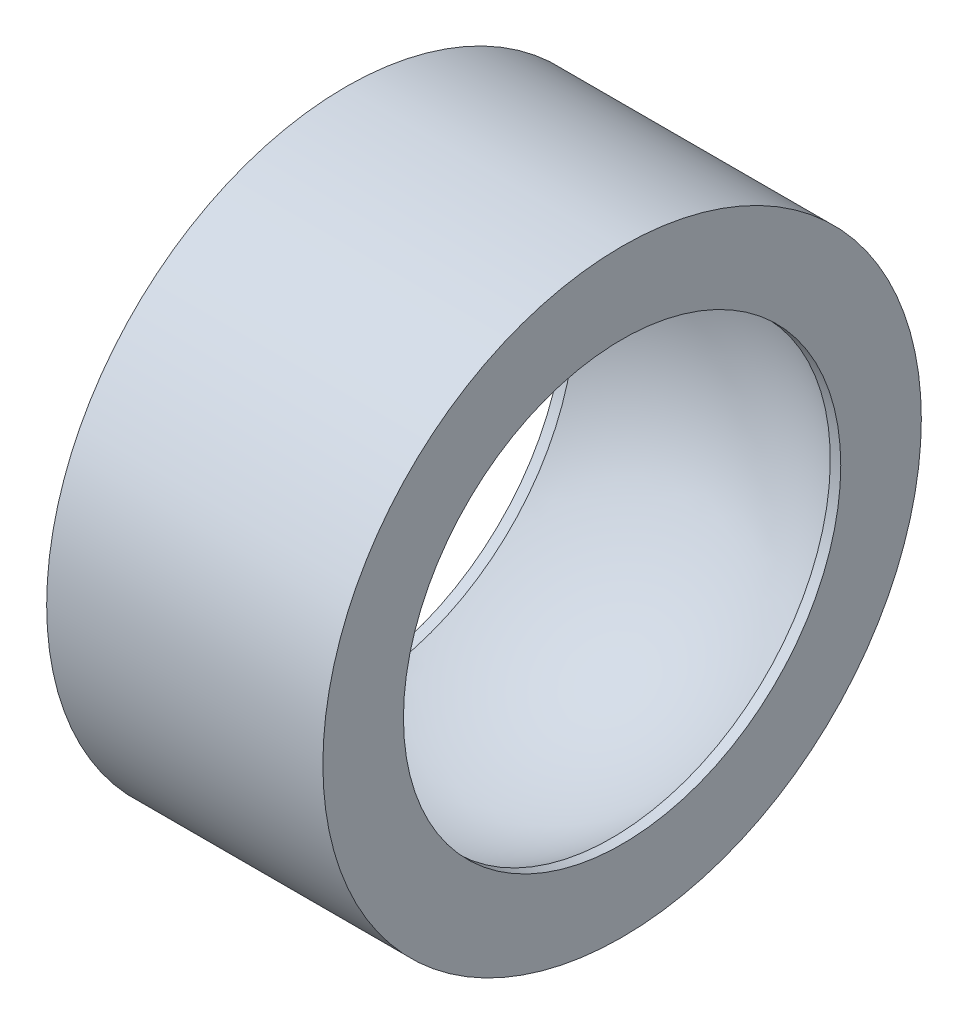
ISO-10303-21;
HEADER;
FILE_DESCRIPTION(('STEP AP214'),'2;1');
FILE_NAME('part.step','',(''),(''),'','','');
FILE_SCHEMA(('AUTOMOTIVE_DESIGN { 1 0 10303 214 1 1 1 1 }'));
ENDSEC;
DATA;
#1=APPLICATION_CONTEXT('core data for automotive mechanical design processes');
#2=APPLICATION_PROTOCOL_DEFINITION('international standard','automotive_design',2000,#1);
#3=PRODUCT_CONTEXT('',#1,'mechanical');
#4=PRODUCT('Part','Part','',(#3));
#5=PRODUCT_RELATED_PRODUCT_CATEGORY('part','',(#4));
#6=PRODUCT_DEFINITION_FORMATION('','',#4);
#7=PRODUCT_DEFINITION_CONTEXT('part definition',#1,'design');
#8=PRODUCT_DEFINITION('design','',#6,#7);
#9=PRODUCT_DEFINITION_SHAPE('','',#8);
#10=(LENGTH_UNIT() NAMED_UNIT(*) SI_UNIT(.MILLI.,.METRE.));
#11=(NAMED_UNIT(*) PLANE_ANGLE_UNIT() SI_UNIT($,.RADIAN.));
#12=(NAMED_UNIT(*) SI_UNIT($,.STERADIAN.) SOLID_ANGLE_UNIT());
#13=UNCERTAINTY_MEASURE_WITH_UNIT(LENGTH_MEASURE(1.E-05),#10,'distance_accuracy_value','');
#14=(GEOMETRIC_REPRESENTATION_CONTEXT(3) GLOBAL_UNCERTAINTY_ASSIGNED_CONTEXT((#13)) GLOBAL_UNIT_ASSIGNED_CONTEXT((#10,
#11,#12)) REPRESENTATION_CONTEXT('',''));
#15=CARTESIAN_POINT('',(0.,0.,0.));
#16=DIRECTION('',(0.,0.,1.));
#17=DIRECTION('',(1.,0.,0.));
#18=AXIS2_PLACEMENT_3D('',#15,#16,#17);
#19=CARTESIAN_POINT('',(0.,13.,0.));
#20=DIRECTION('',(1.,0.,0.));
#21=DIRECTION('',(0.,0.,-1.));
#22=AXIS2_PLACEMENT_3D('',#19,#20,#21);
#23=PLANE('',#22);
#24=CARTESIAN_POINT('',(0.,0.,0.));
#25=DIRECTION('',(-1.,0.,0.));
#26=DIRECTION('',(0.,0.,1.));
#27=AXIS2_PLACEMENT_3D('',#24,#25,#26);
#28=CIRCLE('',#27,9.5);
#29=CARTESIAN_POINT('',(0.,0.,9.5));
#30=VERTEX_POINT('',#29);
#31=EDGE_CURVE('E10',#30,#30,#28,.T.);
#32=ORIENTED_EDGE('',*,*,#31,.F.);
#33=EDGE_LOOP('',(#32));
#34=FACE_BOUND('',#33,.T.);
#35=CARTESIAN_POINT('',(0.,0.,0.));
#36=DIRECTION('',(-1.,0.,0.));
#37=DIRECTION('',(0.,0.,1.));
#38=AXIS2_PLACEMENT_3D('',#35,#36,#37);
#39=CIRCLE('',#38,13.);
#40=CARTESIAN_POINT('',(0.,0.,13.));
#41=VERTEX_POINT('',#40);
#42=EDGE_CURVE('E48',#41,#41,#39,.T.);
#43=ORIENTED_EDGE('',*,*,#42,.T.);
#44=EDGE_LOOP('',(#43));
#45=FACE_BOUND('',#44,.T.);
#46=ADVANCED_FACE('F26',(#34,#45),#23,.F.);
#47=CARTESIAN_POINT('',(0.,0.,0.));
#48=DIRECTION('',(-1.,0.,0.));
#49=DIRECTION('',(0.,0.,1.));
#50=AXIS2_PLACEMENT_3D('',#47,#48,#49);
#51=CYLINDRICAL_SURFACE('',#50,9.5);
#52=CARTESIAN_POINT('',(0.454731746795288,0.,0.));
#53=DIRECTION('',(-1.,0.,0.));
#54=DIRECTION('',(0.,0.,1.));
#55=AXIS2_PLACEMENT_3D('',#52,#53,#54);
#56=CIRCLE('',#55,9.5);
#57=CARTESIAN_POINT('',(0.454731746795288,9.5,0.));
#58=VERTEX_POINT('',#57);
#59=EDGE_CURVE('E32',#58,#58,#56,.T.);
#60=ORIENTED_EDGE('',*,*,#59,.F.);
#61=EDGE_LOOP('',(#60));
#62=FACE_BOUND('',#61,.T.);
#63=ORIENTED_EDGE('',*,*,#31,.T.);
#64=EDGE_LOOP('',(#63));
#65=FACE_BOUND('',#64,.T.);
#66=ADVANCED_FACE('F73',(#62,#65),#51,.F.);
#67=CARTESIAN_POINT('',(6.,0.,0.));
#68=DIRECTION('',(-1.,0.,0.));
#69=DIRECTION('',(0.,1.,0.));
#70=AXIS2_PLACEMENT_3D('',#67,#68,#69);
#71=SPHERICAL_SURFACE('',#70,11.);
#72=CARTESIAN_POINT('',(11.5452682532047,0.,0.));
#73=DIRECTION('',(-1.,0.,0.));
#74=DIRECTION('',(0.,0.,1.));
#75=AXIS2_PLACEMENT_3D('',#72,#73,#74);
#76=CIRCLE('',#75,9.5);
#77=CARTESIAN_POINT('',(11.5452682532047,9.5,0.));
#78=VERTEX_POINT('',#77);
#79=EDGE_CURVE('E36',#78,#78,#76,.T.);
#80=CARTESIAN_POINT('',(11.5452682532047,9.5,0.));
#81=CARTESIAN_POINT('',(11.4406979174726,9.56103991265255,0.));
#82=CARTESIAN_POINT('',(11.3351190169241,9.6203518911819,0.));
#83=CARTESIAN_POINT('',(11.1220608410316,9.73545833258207,0.));
#84=CARTESIAN_POINT('',(11.0145815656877,9.79125279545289,0.));
#85=CARTESIAN_POINT('',(10.7978393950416,9.89926255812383,0.));
#86=CARTESIAN_POINT('',(10.6885764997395,9.95147785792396,0.));
#87=CARTESIAN_POINT('',(10.4683863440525,10.0522725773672,0.));
#88=CARTESIAN_POINT('',(10.3574590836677,10.1008519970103,0.));
#89=CARTESIAN_POINT('',(10.1340611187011,10.1943219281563,0.));
#90=CARTESIAN_POINT('',(10.0215904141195,10.2392124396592,0.));
#91=CARTESIAN_POINT('',(9.79522820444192,10.3252556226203,0.));
#92=CARTESIAN_POINT('',(9.68133669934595,10.3664082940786,0.));
#93=CARTESIAN_POINT('',(9.45225707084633,10.4449309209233,0.));
#94=CARTESIAN_POINT('',(9.33706894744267,10.4823008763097,0.));
#95=CARTESIAN_POINT('',(9.10552168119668,10.5532173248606,0.));
#96=CARTESIAN_POINT('',(8.98916253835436,10.586763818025,0.));
#97=CARTESIAN_POINT('',(8.75540010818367,10.6499967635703,0.));
#98=CARTESIAN_POINT('',(8.6379968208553,10.6796832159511,0.));
#99=CARTESIAN_POINT('',(8.40227411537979,10.7351637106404,0.));
#100=CARTESIAN_POINT('',(8.28395469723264,10.7609577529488,0.));
#101=CARTESIAN_POINT('',(8.04652874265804,10.8086253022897,0.));
#102=CARTESIAN_POINT('',(7.92742220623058,10.8304988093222,0.));
#103=CARTESIAN_POINT('',(7.68855188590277,10.870301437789,0.));
#104=CARTESIAN_POINT('',(7.56878810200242,10.8882305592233,0.));
#105=CARTESIAN_POINT('',(7.32873387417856,10.9201248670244,0.));
#106=CARTESIAN_POINT('',(7.20844343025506,10.9340900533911,0.));
#107=CARTESIAN_POINT('',(6.9674670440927,10.9580412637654,0.));
#108=CARTESIAN_POINT('',(6.84678110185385,10.9680272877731,0.));
#109=CARTESIAN_POINT('',(6.60514531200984,10.9840092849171,0.));
#110=CARTESIAN_POINT('',(6.48419546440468,10.9900052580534,0.));
#111=CARTESIAN_POINT('',(6.24216374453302,10.9980006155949,0.));
#112=CARTESIAN_POINT('',(6.12108187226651,11.,0.));
#113=CARTESIAN_POINT('',(5.87891812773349,11.,0.));
#114=CARTESIAN_POINT('',(5.75783625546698,10.9980006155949,0.));
#115=CARTESIAN_POINT('',(5.51580453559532,10.9900052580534,0.));
#116=CARTESIAN_POINT('',(5.39485468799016,10.9840092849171,0.));
#117=CARTESIAN_POINT('',(5.15321889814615,10.9680272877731,0.));
#118=CARTESIAN_POINT('',(5.0325329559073,10.9580412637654,0.));
#119=CARTESIAN_POINT('',(4.79155656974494,10.9340900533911,0.));
#120=CARTESIAN_POINT('',(4.67126612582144,10.9201248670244,0.));
#121=CARTESIAN_POINT('',(4.43121189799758,10.8882305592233,0.));
#122=CARTESIAN_POINT('',(4.31144811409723,10.870301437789,0.));
#123=CARTESIAN_POINT('',(4.07257779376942,10.8304988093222,0.));
#124=CARTESIAN_POINT('',(3.95347125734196,10.8086253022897,0.));
#125=CARTESIAN_POINT('',(3.71604530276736,10.7609577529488,0.));
#126=CARTESIAN_POINT('',(3.59772588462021,10.7351637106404,0.));
#127=CARTESIAN_POINT('',(3.3620031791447,10.6796832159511,0.));
#128=CARTESIAN_POINT('',(3.24459989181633,10.6499967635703,0.));
#129=CARTESIAN_POINT('',(3.01083746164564,10.586763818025,0.));
#130=CARTESIAN_POINT('',(2.89447831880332,10.5532173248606,0.));
#131=CARTESIAN_POINT('',(2.66293105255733,10.4823008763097,0.));
#132=CARTESIAN_POINT('',(2.54774292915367,10.4449309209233,0.));
#133=CARTESIAN_POINT('',(2.31866330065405,10.3664082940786,0.));
#134=CARTESIAN_POINT('',(2.20477179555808,10.3252556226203,0.));
#135=CARTESIAN_POINT('',(1.97840958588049,10.2392124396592,0.));
#136=CARTESIAN_POINT('',(1.86593888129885,10.1943219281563,0.));
#137=CARTESIAN_POINT('',(1.64254091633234,10.1008519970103,0.));
#138=CARTESIAN_POINT('',(1.53161365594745,10.0522725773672,0.));
#139=CARTESIAN_POINT('',(1.31142350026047,9.95147785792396,0.));
#140=CARTESIAN_POINT('',(1.20216060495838,9.89926255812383,0.));
#141=CARTESIAN_POINT('',(0.985418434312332,9.79125279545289,0.));
#142=CARTESIAN_POINT('',(0.877939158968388,9.73545833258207,0.));
#143=CARTESIAN_POINT('',(0.664880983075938,9.6203518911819,0.));
#144=CARTESIAN_POINT('',(0.559302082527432,9.56103991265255,0.));
#145=CARTESIAN_POINT('',(0.454731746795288,9.5,0.));
#146=B_SPLINE_CURVE_WITH_KNOTS('',3,(#80,#81,#82,#83,#84,#85,#86,#87,#88,#89,#90,#91,#92,#93,
#94,#95,#96,#97,#98,#99,#100,#101,#102,#103,#104,#105,#106,#107,#108,#109,#110,#111,#112,#113,
#114,#115,#116,#117,#118,#119,#120,#121,#122,#123,#124,#125,#126,#127,#128,#129,#130,#131,#132,
#133,#134,#135,#136,#137,#138,#139,#140,#141,#142,#143,#144,#145),.UNSPECIFIED.,.F.,.F.,(4,2,2,
2,2,2,2,2,2,2,2,2,2,2,2,2,2,2,2,2,2,2,2,2,2,2,2,2,2,2,2,2,4),(0.,0.363229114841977,
0.726458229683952,1.08968734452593,1.4529164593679,1.81614557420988,2.17937468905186,
2.54260380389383,2.90583291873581,3.26906203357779,3.63229114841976,3.99552026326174,
4.35874937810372,4.72197849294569,5.08520760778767,5.44843672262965,5.81166583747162,
6.1748949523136,6.53812406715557,6.90135318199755,7.26458229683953,7.6278114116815,
7.99104052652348,8.35426964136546,8.71749875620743,9.08072787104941,9.44395698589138,
9.80718610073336,10.1704152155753,10.5336443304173,10.8968734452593,11.2601025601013,
11.6233316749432),.UNSPECIFIED.);
#147=EDGE_CURVE('BSEAM68',#78,#58,#146,.T.);
#148=ORIENTED_EDGE('',*,*,#79,.F.);
#149=ORIENTED_EDGE('',*,*,#59,.T.);
#150=ORIENTED_EDGE('',*,*,#147,.T.);
#151=ORIENTED_EDGE('',*,*,#147,.F.);
#152=EDGE_LOOP('',(#148,#150,#149,#151));
#153=FACE_BOUND('',#152,.T.);
#154=ADVANCED_FACE('F68',(#153),#71,.F.);
#155=CARTESIAN_POINT('',(0.,0.,0.));
#156=DIRECTION('',(-1.,0.,0.));
#157=DIRECTION('',(0.,0.,1.));
#158=AXIS2_PLACEMENT_3D('',#155,#156,#157);
#159=CYLINDRICAL_SURFACE('',#158,9.5);
#160=CARTESIAN_POINT('',(12.,0.,0.));
#161=DIRECTION('',(-1.,0.,0.));
#162=DIRECTION('',(0.,0.,1.));
#163=AXIS2_PLACEMENT_3D('',#160,#161,#162);
#164=CIRCLE('',#163,9.5);
#165=CARTESIAN_POINT('',(12.,0.,9.5));
#166=VERTEX_POINT('',#165);
#167=EDGE_CURVE('E40',#166,#166,#164,.T.);
#168=ORIENTED_EDGE('',*,*,#167,.F.);
#169=EDGE_LOOP('',(#168));
#170=FACE_BOUND('',#169,.T.);
#171=ORIENTED_EDGE('',*,*,#79,.T.);
#172=EDGE_LOOP('',(#171));
#173=FACE_BOUND('',#172,.T.);
#174=ADVANCED_FACE('F62',(#170,#173),#159,.F.);
#175=CARTESIAN_POINT('',(12.,13.,0.));
#176=DIRECTION('',(-1.,0.,0.));
#177=DIRECTION('',(0.,0.,1.));
#178=AXIS2_PLACEMENT_3D('',#175,#176,#177);
#179=PLANE('',#178);
#180=CARTESIAN_POINT('',(12.,0.,0.));
#181=DIRECTION('',(-1.,0.,0.));
#182=DIRECTION('',(0.,0.,1.));
#183=AXIS2_PLACEMENT_3D('',#180,#181,#182);
#184=CIRCLE('',#183,13.);
#185=CARTESIAN_POINT('',(12.,0.,13.));
#186=VERTEX_POINT('',#185);
#187=EDGE_CURVE('E45',#186,#186,#184,.T.);
#188=ORIENTED_EDGE('',*,*,#187,.F.);
#189=EDGE_LOOP('',(#188));
#190=FACE_BOUND('',#189,.T.);
#191=ORIENTED_EDGE('',*,*,#167,.T.);
#192=EDGE_LOOP('',(#191));
#193=FACE_BOUND('',#192,.T.);
#194=ADVANCED_FACE('F56',(#190,#193),#179,.F.);
#195=CARTESIAN_POINT('',(0.,0.,0.));
#196=DIRECTION('',(-1.,0.,0.));
#197=DIRECTION('',(0.,0.,1.));
#198=AXIS2_PLACEMENT_3D('',#195,#196,#197);
#199=CYLINDRICAL_SURFACE('',#198,13.);
#200=ORIENTED_EDGE('',*,*,#42,.F.);
#201=EDGE_LOOP('',(#200));
#202=FACE_BOUND('',#201,.T.);
#203=ORIENTED_EDGE('',*,*,#187,.T.);
#204=EDGE_LOOP('',(#203));
#205=FACE_BOUND('',#204,.T.);
#206=ADVANCED_FACE('F53',(#202,#205),#199,.T.);
#207=CLOSED_SHELL('',(#46,#66,#154,#174,#194,#206));
#208=MANIFOLD_SOLID_BREP('B2',#207);
#209=ADVANCED_BREP_SHAPE_REPRESENTATION('',(#18,#208),#14);
#210=SHAPE_DEFINITION_REPRESENTATION(#9,#209);
ENDSEC;
END-ISO-10303-21;
